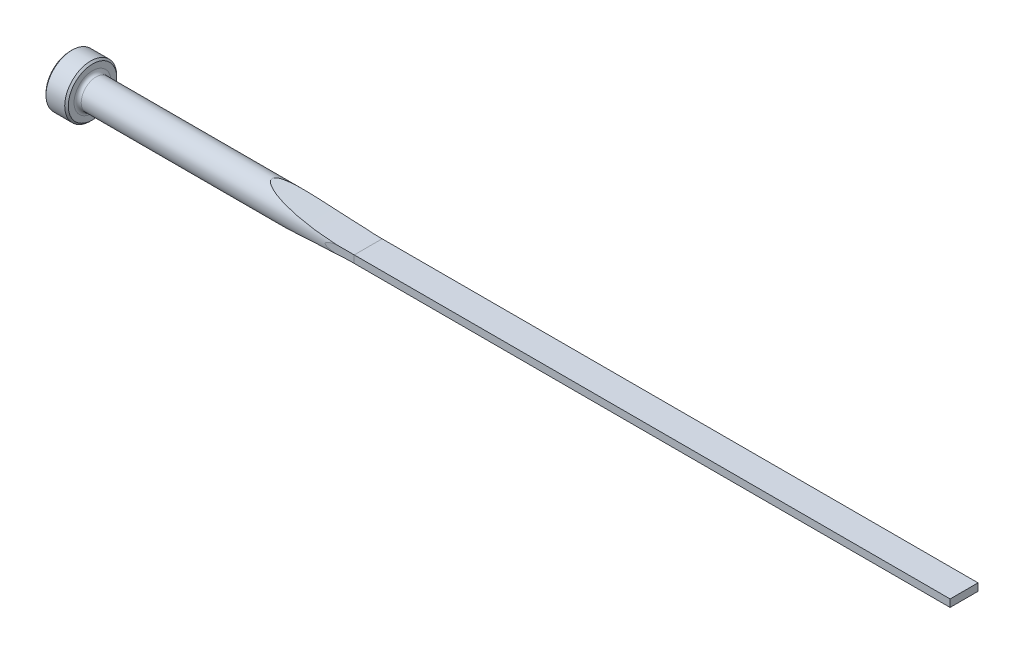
ISO-10303-21;
HEADER;
FILE_DESCRIPTION(('STEP AP214'),'2;1');
FILE_NAME('part.step','',(''),(''),'','','');
FILE_SCHEMA(('AUTOMOTIVE_DESIGN { 1 0 10303 214 1 1 1 1 }'));
ENDSEC;
DATA;
#1=APPLICATION_CONTEXT('core data for automotive mechanical design processes');
#2=APPLICATION_PROTOCOL_DEFINITION('international standard','automotive_design',2000,#1);
#3=PRODUCT_CONTEXT('',#1,'mechanical');
#4=PRODUCT('Part','Part','',(#3));
#5=PRODUCT_RELATED_PRODUCT_CATEGORY('part','',(#4));
#6=PRODUCT_DEFINITION_FORMATION('','',#4);
#7=PRODUCT_DEFINITION_CONTEXT('part definition',#1,'design');
#8=PRODUCT_DEFINITION('design','',#6,#7);
#9=PRODUCT_DEFINITION_SHAPE('','',#8);
#10=(LENGTH_UNIT() NAMED_UNIT(*) SI_UNIT(.MILLI.,.METRE.));
#11=(NAMED_UNIT(*) PLANE_ANGLE_UNIT() SI_UNIT($,.RADIAN.));
#12=(NAMED_UNIT(*) SI_UNIT($,.STERADIAN.) SOLID_ANGLE_UNIT());
#13=UNCERTAINTY_MEASURE_WITH_UNIT(LENGTH_MEASURE(1.E-05),#10,'distance_accuracy_value','');
#14=(GEOMETRIC_REPRESENTATION_CONTEXT(3) GLOBAL_UNCERTAINTY_ASSIGNED_CONTEXT((#13)) GLOBAL_UNIT_ASSIGNED_CONTEXT((#10,
#11,#12)) REPRESENTATION_CONTEXT('',''));
#15=CARTESIAN_POINT('',(0.,0.,0.));
#16=DIRECTION('',(0.,0.,1.));
#17=DIRECTION('',(1.,0.,0.));
#18=AXIS2_PLACEMENT_3D('',#15,#16,#17);
#19=CARTESIAN_POINT('',(0.,0.,0.));
#20=DIRECTION('',(-1.,0.,0.));
#21=DIRECTION('',(0.,0.,1.));
#22=AXIS2_PLACEMENT_3D('',#19,#20,#21);
#23=CYLINDRICAL_SURFACE('',#22,3.175);
#24=CARTESIAN_POINT('',(5.5118,0.,0.));
#25=DIRECTION('',(-1.,0.,0.));
#26=DIRECTION('',(0.,0.,1.));
#27=AXIS2_PLACEMENT_3D('',#24,#25,#26);
#28=CIRCLE('',#27,3.175);
#29=CARTESIAN_POINT('',(5.5118,0.,3.175));
#30=VERTEX_POINT('',#29);
#31=EDGE_CURVE('E153',#30,#30,#28,.F.);
#32=ORIENTED_EDGE('',*,*,#31,.T.);
#33=EDGE_LOOP('',(#32));
#34=FACE_BOUND('',#33,.T.);
#35=CARTESIAN_POINT('',(63.5,1.11760000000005,2.97179999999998));
#36=CARTESIAN_POINT('',(63.2357957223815,1.11753103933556,2.9717988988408));
#37=CARTESIAN_POINT('',(62.9715815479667,1.11446404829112,2.97297778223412));
#38=CARTESIAN_POINT('',(62.443191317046,1.10185346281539,2.97768913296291));
#39=CARTESIAN_POINT('',(62.1790153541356,1.09230645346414,2.98122284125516));
#40=CARTESIAN_POINT('',(61.6493837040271,1.06617269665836,2.9906669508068));
#41=CARTESIAN_POINT('',(61.3839303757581,1.04954219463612,2.99659211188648));
#42=CARTESIAN_POINT('',(60.8537877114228,1.00807205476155,3.01079697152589));
#43=CARTESIAN_POINT('',(60.5890982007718,0.983234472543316,3.01907608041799));
#44=CARTESIAN_POINT('',(60.0615789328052,0.92338352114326,3.03792875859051));
#45=CARTESIAN_POINT('',(59.7987461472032,0.888396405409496,3.04849639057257));
#46=CARTESIAN_POINT('',(59.4064659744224,0.825064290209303,3.06600005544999));
#47=CARTESIAN_POINT('',(59.2761087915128,0.802161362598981,3.07210597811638));
#48=CARTESIAN_POINT('',(59.0163554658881,0.751700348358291,3.08484243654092));
#49=CARTESIAN_POINT('',(58.8869590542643,0.724143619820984,3.09147281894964));
#50=CARTESIAN_POINT('',(58.6294078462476,0.662714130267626,3.10522998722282));
#51=CARTESIAN_POINT('',(58.5012554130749,0.628831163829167,3.11235756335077));
#52=CARTESIAN_POINT('',(58.3111286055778,0.570760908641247,3.12333709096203));
#53=CARTESIAN_POINT('',(58.2480498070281,0.550175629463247,3.12704828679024));
#54=CARTESIAN_POINT('',(58.1230456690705,0.505797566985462,3.13453462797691));
#55=CARTESIAN_POINT('',(58.061119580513,0.482006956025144,3.13830972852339));
#56=CARTESIAN_POINT('',(57.9388265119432,0.42976946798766,3.1458898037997));
#57=CARTESIAN_POINT('',(57.8784713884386,0.401294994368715,3.14969481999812));
#58=CARTESIAN_POINT('',(57.761395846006,0.337410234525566,3.1571914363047));
#59=CARTESIAN_POINT('',(57.7046630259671,0.302025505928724,3.16088339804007));
#60=CARTESIAN_POINT('',(57.6318457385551,0.243613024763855,3.16568281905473));
#61=CARTESIAN_POINT('',(57.6116878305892,0.225790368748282,3.16701915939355));
#62=CARTESIAN_POINT('',(57.5741240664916,0.187442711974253,3.16952077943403));
#63=CARTESIAN_POINT('',(57.5567070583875,0.166929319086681,3.17068675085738));
#64=CARTESIAN_POINT('',(57.5335834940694,0.132884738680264,3.17224001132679));
#65=CARTESIAN_POINT('',(57.5261886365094,0.120518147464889,3.17273788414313));
#66=CARTESIAN_POINT('',(57.5132601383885,0.0948283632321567,3.1736095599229));
#67=CARTESIAN_POINT('',(57.5077252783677,0.0815058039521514,3.17398344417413));
#68=CARTESIAN_POINT('',(57.4990082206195,0.053897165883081,3.1745727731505));
#69=CARTESIAN_POINT('',(57.4958567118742,0.0396010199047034,3.17478615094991));
#70=CARTESIAN_POINT('',(57.4924789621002,0.0106696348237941,3.17501485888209));
#71=CARTESIAN_POINT('',(57.4922487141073,-0.00396511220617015,3.17503046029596));
#72=CARTESIAN_POINT('',(57.4945596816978,-0.0309283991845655,3.17487397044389));
#73=CARTESIAN_POINT('',(57.4967167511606,-0.0432925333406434,3.17472789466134));
#74=CARTESIAN_POINT('',(57.5029656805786,-0.0675187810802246,3.17430516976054));
#75=CARTESIAN_POINT('',(57.5070594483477,-0.0793803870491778,3.17402839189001));
#76=CARTESIAN_POINT('',(57.5191372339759,-0.107852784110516,3.17321302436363));
#77=CARTESIAN_POINT('',(57.5280454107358,-0.124065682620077,3.17261252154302));
#78=CARTESIAN_POINT('',(57.5482326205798,-0.154926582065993,3.17125564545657));
#79=CARTESIAN_POINT('',(57.5595181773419,-0.169570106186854,3.1704988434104));
#80=CARTESIAN_POINT('',(57.5944341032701,-0.209900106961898,3.16816531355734));
#81=CARTESIAN_POINT('',(57.6200991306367,-0.233790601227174,3.16645919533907));
#82=CARTESIAN_POINT('',(57.6742928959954,-0.277993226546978,3.1628833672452));
#83=CARTESIAN_POINT('',(57.702830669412,-0.298293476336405,3.16101314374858));
#84=CARTESIAN_POINT('',(57.7823413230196,-0.349789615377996,3.155843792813));
#85=CARTESIAN_POINT('',(57.8348887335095,-0.37851929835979,3.15247078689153));
#86=CARTESIAN_POINT('',(57.9423072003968,-0.431320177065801,3.14567655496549));
#87=CARTESIAN_POINT('',(57.9971839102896,-0.455379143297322,3.14225522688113));
#88=CARTESIAN_POINT('',(58.1085705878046,-0.500302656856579,3.13541729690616));
#89=CARTESIAN_POINT('',(58.165087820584,-0.521149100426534,3.13200082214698));
#90=CARTESIAN_POINT('',(58.2788979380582,-0.560302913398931,3.12523191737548));
#91=CARTESIAN_POINT('',(58.3361896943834,-0.578613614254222,3.12187940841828));
#92=CARTESIAN_POINT('',(58.5297297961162,-0.636913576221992,3.1107447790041));
#93=CARTESIAN_POINT('',(58.6673130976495,-0.672489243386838,3.10314401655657));
#94=CARTESIAN_POINT('',(58.9441302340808,-0.736755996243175,3.0885058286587));
#95=CARTESIAN_POINT('',(59.0833651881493,-0.765442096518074,3.08146881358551));
#96=CARTESIAN_POINT('',(59.3631295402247,-0.817784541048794,3.06799404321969));
#97=CARTESIAN_POINT('',(59.5036611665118,-0.841429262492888,3.06155769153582));
#98=CARTESIAN_POINT('',(59.7853732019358,-0.884713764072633,3.04932851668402));
#99=CARTESIAN_POINT('',(59.9265536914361,-0.904353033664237,3.04353577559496));
#100=CARTESIAN_POINT('',(60.3506897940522,-0.95834898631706,3.02714982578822));
#101=CARTESIAN_POINT('',(60.6343099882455,-0.987796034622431,3.01754551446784));
#102=CARTESIAN_POINT('',(61.202086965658,-1.03680456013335,3.00105004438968));
#103=CARTESIAN_POINT('',(61.4862426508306,-1.05637822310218,2.99415554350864));
#104=CARTESIAN_POINT('',(61.9149168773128,-1.079629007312,2.98581493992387));
#105=CARTESIAN_POINT('',(62.059256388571,-1.08638681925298,2.98335806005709));
#106=CARTESIAN_POINT('',(62.3480641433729,-1.0978849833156,2.97914616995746));
#107=CARTESIAN_POINT('',(62.4925324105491,-1.1026248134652,2.97739134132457));
#108=CARTESIAN_POINT('',(62.780840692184,-1.1101534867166,2.97459254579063));
#109=CARTESIAN_POINT('',(62.9246804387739,-1.11295147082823,2.97354524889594));
#110=CARTESIAN_POINT('',(63.2123469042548,-1.11667170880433,2.97214903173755));
#111=CARTESIAN_POINT('',(63.3561736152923,-1.11759449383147,2.97179991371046));
#112=CARTESIAN_POINT('',(63.5,-1.11760000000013,2.97179999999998));
#113=B_SPLINE_CURVE_WITH_KNOTS('',3,(#35,#36,#37,#38,#39,#40,#41,#42,#43,#44,#45,#46,#47,#48,
#49,#50,#51,#52,#53,#54,#55,#56,#57,#58,#59,#60,#61,#62,#63,#64,#65,#66,#67,#68,#69,#70,#71,#72,
#73,#74,#75,#76,#77,#78,#79,#80,#81,#82,#83,#84,#85,#86,#87,#88,#89,#90,#91,#92,#93,#94,#95,#96,
#97,#98,#99,#100,#101,#102,#103,#104,#105,#106,#107,#108,#109,#110,#111,#112),.UNSPECIFIED.,.F.,
.F.,(4,2,2,2,2,2,2,2,2,2,2,2,2,2,2,2,2,2,2,2,2,2,2,2,2,2,2,2,2,2,2,2,2,2,2,2,2,2,4),(0.,
0.792608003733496,1.58563403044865,2.38363126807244,3.18142878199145,3.97718078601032,
4.37459807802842,4.77189959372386,5.16984765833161,5.36916585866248,5.56834964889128,
5.7687520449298,5.96842682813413,6.04909120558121,6.12941838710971,6.17255460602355,
6.21566248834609,6.25931641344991,6.30291045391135,6.34039079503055,6.37790813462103,
6.43311579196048,6.48847696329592,6.59320183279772,6.69826703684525,6.87774508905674,
7.05768691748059,7.23860836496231,7.41928981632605,7.84588397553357,8.2727859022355,
8.70066164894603,9.12859189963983,9.98423938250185,10.8388282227,11.2723701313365,
11.7060241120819,12.1376226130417,12.569098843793),.UNSPECIFIED.);
#114=CARTESIAN_POINT('',(59.6853026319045,0.86928200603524,3.05368200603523));
#115=VERTEX_POINT('',#114);
#116=CARTESIAN_POINT('',(59.6853026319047,-0.869282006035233,3.05368200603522));
#117=VERTEX_POINT('',#116);
#118=EDGE_CURVE('E156',#115,#117,#113,.T.);
#119=ORIENTED_EDGE('',*,*,#118,.F.);
#120=CARTESIAN_POINT('',(63.5,0.787399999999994,3.07581310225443));
#121=CARTESIAN_POINT('',(63.2355438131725,0.78739999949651,3.07581083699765));
#122=CARTESIAN_POINT('',(62.9710891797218,0.788580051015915,3.07551132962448));
#123=CARTESIAN_POINT('',(62.4422022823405,0.793300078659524,3.07429803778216));
#124=CARTESIAN_POINT('',(62.1777700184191,0.796840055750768,3.0733842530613));
#125=CARTESIAN_POINT('',(61.3844189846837,0.81100169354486,3.0696912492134));
#126=CARTESIAN_POINT('',(60.8555630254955,0.82516506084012,3.06596036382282));
#127=CARTESIAN_POINT('',(59.7968502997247,0.8629777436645,3.05553241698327));
#128=CARTESIAN_POINT('',(59.2669944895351,0.8866515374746,3.04882769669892));
#129=CARTESIAN_POINT('',(58.2079603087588,0.943468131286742,3.03172836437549));
#130=CARTESIAN_POINT('',(57.6787818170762,0.976608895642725,3.02133454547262));
#131=CARTESIAN_POINT('',(56.6997492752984,1.04671882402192,2.99769210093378));
#132=CARTESIAN_POINT('',(56.2497861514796,1.08238846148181,2.98509669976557));
#133=CARTESIAN_POINT('',(55.3505791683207,1.16056445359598,2.9555818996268));
#134=CARTESIAN_POINT('',(54.9013353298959,1.20307100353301,2.93866237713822));
#135=CARTESIAN_POINT('',(54.003288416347,1.29494318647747,2.89935313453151));
#136=CARTESIAN_POINT('',(53.5544863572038,1.34431625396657,2.87695746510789));
#137=CARTESIAN_POINT('',(52.6580959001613,1.44984136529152,2.82525115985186));
#138=CARTESIAN_POINT('',(52.21050743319,1.50599301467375,2.79594092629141));
#139=CARTESIAN_POINT('',(51.3157511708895,1.62515896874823,2.72840404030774));
#140=CARTESIAN_POINT('',(50.8685873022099,1.68819027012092,2.69015502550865));
#141=CARTESIAN_POINT('',(49.9762278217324,1.82090442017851,2.60217475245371));
#142=CARTESIAN_POINT('',(49.5310327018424,1.89058884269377,2.5524407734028));
#143=CARTESIAN_POINT('',(48.8659910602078,1.99985162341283,2.46644191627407));
#144=CARTESIAN_POINT('',(48.6450024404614,2.03701989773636,2.43591445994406));
#145=CARTESIAN_POINT('',(48.2039601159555,2.11291046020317,2.37039160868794));
#146=CARTESIAN_POINT('',(47.9839063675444,2.15163267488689,2.33539642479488));
#147=CARTESIAN_POINT('',(47.5450648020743,2.23055506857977,2.26013733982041));
#148=CARTESIAN_POINT('',(47.3262764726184,2.27075459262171,2.21987575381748));
#149=CARTESIAN_POINT('',(46.8902406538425,2.35255542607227,2.132997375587));
#150=CARTESIAN_POINT('',(46.6729929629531,2.39415654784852,2.08638143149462));
#151=CARTESIAN_POINT('',(46.3477545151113,2.45768704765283,2.01034767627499));
#152=CARTESIAN_POINT('',(46.2389864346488,2.4791456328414,1.9838590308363));
#153=CARTESIAN_POINT('',(46.0220867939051,2.52235662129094,1.9286178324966));
#154=CARTESIAN_POINT('',(45.913955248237,2.54410903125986,1.89986522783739));
#155=CARTESIAN_POINT('',(45.5903801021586,2.60982577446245,1.80970323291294));
#156=CARTESIAN_POINT('',(45.3760432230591,2.65419348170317,1.74445519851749));
#157=CARTESIAN_POINT('',(45.0591981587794,2.72097915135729,1.6366542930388));
#158=CARTESIAN_POINT('',(44.9548736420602,2.74316775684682,1.59927855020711));
#159=CARTESIAN_POINT('',(44.7477705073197,2.78760086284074,1.52051286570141));
#160=CARTESIAN_POINT('',(44.6449915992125,2.80984535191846,1.47912368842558));
#161=CARTESIAN_POINT('',(44.4417053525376,2.85421389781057,1.39157880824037));
#162=CARTESIAN_POINT('',(44.3411937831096,2.87633810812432,1.34543306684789));
#163=CARTESIAN_POINT('',(44.1430959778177,2.9202948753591,1.2471613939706));
#164=CARTESIAN_POINT('',(44.0455078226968,2.9421276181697,1.19503949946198));
#165=CARTESIAN_POINT('',(43.9117813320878,2.97227306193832,1.11659829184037));
#166=CARTESIAN_POINT('',(43.8738115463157,2.9808592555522,1.09349968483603));
#167=CARTESIAN_POINT('',(43.7987226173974,2.9978899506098,1.04590629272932));
#168=CARTESIAN_POINT('',(43.7616035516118,3.00633443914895,1.02141138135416));
#169=CARTESIAN_POINT('',(43.6515401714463,3.03144638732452,0.945421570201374));
#170=CARTESIAN_POINT('',(43.580121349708,3.04784006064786,0.891554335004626));
#171=CARTESIAN_POINT('',(43.4427883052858,3.0795292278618,0.775133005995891));
#172=CARTESIAN_POINT('',(43.3769534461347,3.09480855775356,0.712479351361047));
#173=CARTESIAN_POINT('',(43.2563432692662,3.12292613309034,0.576813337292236));
#174=CARTESIAN_POINT('',(43.2015101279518,3.13577711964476,0.503858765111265));
#175=CARTESIAN_POINT('',(43.1334503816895,3.1517759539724,0.385387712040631));
#176=CARTESIAN_POINT('',(43.1130844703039,3.15657317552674,0.344236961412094));
#177=CARTESIAN_POINT('',(43.078672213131,3.16468806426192,0.259216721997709));
#178=CARTESIAN_POINT('',(43.0646188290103,3.16800737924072,0.2153503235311));
#179=CARTESIAN_POINT('',(43.0441287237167,3.17284949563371,0.125287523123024));
#180=CARTESIAN_POINT('',(43.0377647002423,3.1743551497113,0.0790731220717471));
#181=CARTESIAN_POINT('',(43.033732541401,3.17530892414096,-0.0137573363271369));
#182=CARTESIAN_POINT('',(43.0360615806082,3.17475771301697,-0.0603732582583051));
#183=CARTESIAN_POINT('',(43.0484201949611,3.17183542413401,-0.147654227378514));
#184=CARTESIAN_POINT('',(43.0576480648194,3.16965382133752,-0.188444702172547));
#185=CARTESIAN_POINT('',(43.0819667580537,3.16391143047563,-0.268119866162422));
#186=CARTESIAN_POINT('',(43.0970614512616,3.16034973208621,-0.307003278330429));
#187=CARTESIAN_POINT('',(43.1419420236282,3.149776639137,-0.403821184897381));
#188=CARTESIAN_POINT('',(43.1752036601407,3.14195464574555,-0.460042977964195));
#189=CARTESIAN_POINT('',(43.2496780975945,3.12449841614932,-0.56663425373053));
#190=CARTESIAN_POINT('',(43.2909151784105,3.11485864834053,-0.616985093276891));
#191=CARTESIAN_POINT('',(43.3763515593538,3.09496038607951,-0.709911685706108));
#192=CARTESIAN_POINT('',(43.4202749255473,3.08476245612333,-0.752759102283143));
#193=CARTESIAN_POINT('',(43.5115201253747,3.06365689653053,-0.834515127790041));
#194=CARTESIAN_POINT('',(43.5588452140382,3.05274858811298,-0.873419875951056));
#195=CARTESIAN_POINT('',(43.6560433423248,3.0304333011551,-0.947952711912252));
#196=CARTESIAN_POINT('',(43.70592175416,3.01902527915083,-0.983573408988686));
#197=CARTESIAN_POINT('',(43.8074943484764,2.9958898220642,-1.05193545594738));
#198=CARTESIAN_POINT('',(43.859187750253,2.98416252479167,-1.08467802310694));
#199=CARTESIAN_POINT('',(43.9974109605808,2.95293886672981,-1.16783092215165));
#200=CARTESIAN_POINT('',(44.08513100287,2.93325796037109,-1.21619034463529));
#201=CARTESIAN_POINT('',(44.263186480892,2.89360215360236,-1.30773540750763));
#202=CARTESIAN_POINT('',(44.3535233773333,2.87362709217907,-1.35091808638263));
#203=CARTESIAN_POINT('',(44.5362397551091,2.83353099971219,-1.43311613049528));
#204=CARTESIAN_POINT('',(44.6286227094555,2.81340976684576,-1.47212362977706));
#205=CARTESIAN_POINT('',(44.8148168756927,2.77317207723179,-1.54658525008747));
#206=CARTESIAN_POINT('',(44.9086283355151,2.7530556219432,-1.58203874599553));
#207=CARTESIAN_POINT('',(45.1926824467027,2.69263186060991,-1.68424564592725));
#208=CARTESIAN_POINT('',(45.3846014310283,2.65245744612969,-1.74643627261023));
#209=CARTESIAN_POINT('',(45.6744533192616,2.59279838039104,-1.83281823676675));
#210=CARTESIAN_POINT('',(45.7713413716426,2.57302402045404,-1.86044719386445));
#211=CARTESIAN_POINT('',(45.9657197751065,2.53369185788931,-1.91366898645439));
#212=CARTESIAN_POINT('',(46.0632101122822,2.51413405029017,-1.93926186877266));
#213=CARTESIAN_POINT('',(46.3708756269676,2.45295213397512,-2.01698242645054));
#214=CARTESIAN_POINT('',(46.5819621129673,2.41176464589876,-2.0658523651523));
#215=CARTESIAN_POINT('',(47.0058251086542,2.3306671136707,-2.15692409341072));
#216=CARTESIAN_POINT('',(47.2186018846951,2.29075727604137,-2.19912480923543));
#217=CARTESIAN_POINT('',(47.6455328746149,2.21230068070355,-2.27803601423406));
#218=CARTESIAN_POINT('',(47.8596877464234,2.17375464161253,-2.31474364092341));
#219=CARTESIAN_POINT('',(48.2890012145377,2.0981138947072,-2.38351552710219));
#220=CARTESIAN_POINT('',(48.5041598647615,2.06101926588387,-2.41557953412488));
#221=CARTESIAN_POINT('',(49.1518637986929,1.95181443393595,-2.50600220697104));
#222=CARTESIAN_POINT('',(49.5856254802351,1.88196933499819,-2.55841192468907));
#223=CARTESIAN_POINT('',(50.4552081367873,1.74857514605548,-2.65135263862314));
#224=CARTESIAN_POINT('',(50.8910284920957,1.68502427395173,-2.69188700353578));
#225=CARTESIAN_POINT('',(51.764605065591,1.56427552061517,-2.76380276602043));
#226=CARTESIAN_POINT('',(52.2023624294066,1.50708213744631,-2.79517770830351));
#227=CARTESIAN_POINT('',(53.0791511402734,1.39917293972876,-2.85072181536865));
#228=CARTESIAN_POINT('',(53.5181825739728,1.34845757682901,-2.87489047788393));
#229=CARTESIAN_POINT('',(54.3966640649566,1.2536156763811,-2.91749372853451));
#230=CARTESIAN_POINT('',(54.8361128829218,1.20948085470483,-2.93593555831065));
#231=CARTESIAN_POINT('',(55.7157867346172,1.12775252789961,-2.96828666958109));
#232=CARTESIAN_POINT('',(56.1560117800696,1.09015912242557,-2.98219588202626));
#233=CARTESIAN_POINT('',(57.1721267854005,1.01101466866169,-3.01010743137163));
#234=CARTESIAN_POINT('',(57.7482336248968,0.971783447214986,-3.02283110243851));
#235=CARTESIAN_POINT('',(58.9013377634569,0.904541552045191,-3.04362622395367));
#236=CARTESIAN_POINT('',(59.4783352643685,0.876533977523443,-3.05169638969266));
#237=CARTESIAN_POINT('',(60.629420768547,0.831901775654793,-3.06416391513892));
#238=CARTESIAN_POINT('',(61.2035059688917,0.81521129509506,-3.06858255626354));
#239=CARTESIAN_POINT('',(62.0647116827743,0.798523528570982,-3.07294853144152));
#240=CARTESIAN_POINT('',(62.3517518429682,0.794352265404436,-3.07402686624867));
#241=CARTESIAN_POINT('',(62.9258606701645,0.78879050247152,-3.07545758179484));
#242=CARTESIAN_POINT('',(63.2129293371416,0.787400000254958,-3.07580996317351));
#243=CARTESIAN_POINT('',(63.5,0.78739999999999,-3.07581310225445));
#244=B_SPLINE_CURVE_WITH_KNOTS('',3,(#120,#121,#122,#123,#124,#125,#126,#127,#128,#129,#130,
#131,#132,#133,#134,#135,#136,#137,#138,#139,#140,#141,#142,#143,#144,#145,#146,#147,#148,#149,
#150,#151,#152,#153,#154,#155,#156,#157,#158,#159,#160,#161,#162,#163,#164,#165,#166,#167,#168,
#169,#170,#171,#172,#173,#174,#175,#176,#177,#178,#179,#180,#181,#182,#183,#184,#185,#186,#187,
#188,#189,#190,#191,#192,#193,#194,#195,#196,#197,#198,#199,#200,#201,#202,#203,#204,#205,#206,
#207,#208,#209,#210,#211,#212,#213,#214,#215,#216,#217,#218,#219,#220,#221,#222,#223,#224,#225,
#226,#227,#228,#229,#230,#231,#232,#233,#234,#235,#236,#237,#238,#239,#240,#241,#242,#243),
.UNSPECIFIED.,.F.,.F.,(4,2,2,2,2,2,2,2,2,2,2,2,2,2,2,2,2,2,2,2,2,2,2,2,2,2,2,2,2,2,2,2,2,2,2,2,
2,2,2,2,2,2,2,2,2,2,2,2,2,2,2,2,2,2,2,2,2,2,2,2,2,4),(0.,0.793362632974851,1.58672559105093,
3.1738026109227,4.76499095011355,6.35583739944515,7.71042211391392,9.06504552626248,
10.4211471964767,11.7771699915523,13.1366222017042,14.4963967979,15.1748434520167,
15.8532580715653,16.5313754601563,17.2094024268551,17.5513342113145,17.8932738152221,
18.5780521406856,18.917044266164,19.2559719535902,19.5942037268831,19.9322083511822,
20.0679784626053,20.203760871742,20.476139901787,20.7519011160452,21.0261726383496,
21.1642406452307,21.302154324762,21.4413619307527,21.5805242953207,21.705627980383,
21.8308143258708,22.0270516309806,22.2238960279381,22.4102246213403,22.5967339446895,
22.783653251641,22.9704931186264,23.2765002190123,23.5826815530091,23.8894299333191,
24.1962321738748,24.8129775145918,25.1209844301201,25.4289842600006,26.0904791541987,
26.7520804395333,27.4140252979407,28.0760061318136,29.4030977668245,30.7298125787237,
32.0574601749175,33.3852002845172,34.711254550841,36.0373290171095,37.7699311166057,
39.5030113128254,41.2259182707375,42.087123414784,42.948327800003),.UNSPECIFIED.);
#245=CARTESIAN_POINT('',(59.6853026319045,0.869282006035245,-3.05368200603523));
#246=VERTEX_POINT('',#245);
#247=EDGE_CURVE('E106',#115,#246,#244,.T.);
#248=ORIENTED_EDGE('',*,*,#247,.T.);
#249=CARTESIAN_POINT('',(63.5,1.11760000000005,-2.97179999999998));
#250=CARTESIAN_POINT('',(63.2357957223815,1.11753103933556,-2.9717988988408));
#251=CARTESIAN_POINT('',(62.9715815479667,1.11446404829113,-2.97297778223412));
#252=CARTESIAN_POINT('',(62.443191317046,1.10185346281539,-2.97768913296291));
#253=CARTESIAN_POINT('',(62.1790153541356,1.09230645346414,-2.98122284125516));
#254=CARTESIAN_POINT('',(61.6493837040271,1.06617269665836,-2.9906669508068));
#255=CARTESIAN_POINT('',(61.383930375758,1.04954219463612,-2.99659211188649));
#256=CARTESIAN_POINT('',(60.8537877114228,1.00807205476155,-3.01079697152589));
#257=CARTESIAN_POINT('',(60.5890982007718,0.983234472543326,-3.01907608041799));
#258=CARTESIAN_POINT('',(60.0615789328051,0.923383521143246,-3.03792875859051));
#259=CARTESIAN_POINT('',(59.7987461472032,0.888396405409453,-3.04849639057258));
#260=CARTESIAN_POINT('',(59.4064659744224,0.825064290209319,-3.06600005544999));
#261=CARTESIAN_POINT('',(59.2761087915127,0.802161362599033,-3.07210597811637));
#262=CARTESIAN_POINT('',(59.016355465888,0.751700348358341,-3.08484243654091));
#263=CARTESIAN_POINT('',(58.8869590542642,0.724143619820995,-3.09147281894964));
#264=CARTESIAN_POINT('',(58.6294078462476,0.662714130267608,-3.10522998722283));
#265=CARTESIAN_POINT('',(58.5012554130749,0.628831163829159,-3.11235756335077));
#266=CARTESIAN_POINT('',(58.3111286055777,0.57076090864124,-3.12333709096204));
#267=CARTESIAN_POINT('',(58.2480498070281,0.550175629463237,-3.12704828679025));
#268=CARTESIAN_POINT('',(58.1230456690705,0.505797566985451,-3.13453462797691));
#269=CARTESIAN_POINT('',(58.061119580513,0.482006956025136,-3.13830972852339));
#270=CARTESIAN_POINT('',(57.9388265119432,0.429769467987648,-3.14588980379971));
#271=CARTESIAN_POINT('',(57.8784713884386,0.401294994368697,-3.14969481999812));
#272=CARTESIAN_POINT('',(57.761395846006,0.337410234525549,-3.1571914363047));
#273=CARTESIAN_POINT('',(57.7046630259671,0.302025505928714,-3.16088339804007));
#274=CARTESIAN_POINT('',(57.6318457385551,0.243613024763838,-3.16568281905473));
#275=CARTESIAN_POINT('',(57.6116878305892,0.225790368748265,-3.16701915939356));
#276=CARTESIAN_POINT('',(57.5741240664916,0.187442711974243,-3.16952077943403));
#277=CARTESIAN_POINT('',(57.5567070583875,0.166929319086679,-3.17068675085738));
#278=CARTESIAN_POINT('',(57.5335834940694,0.132884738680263,-3.17224001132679));
#279=CARTESIAN_POINT('',(57.5261886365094,0.120518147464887,-3.17273788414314));
#280=CARTESIAN_POINT('',(57.5132601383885,0.0948283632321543,-3.1736095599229));
#281=CARTESIAN_POINT('',(57.5077252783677,0.0815058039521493,-3.17398344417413));
#282=CARTESIAN_POINT('',(57.4990082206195,0.0538971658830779,-3.1745727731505));
#283=CARTESIAN_POINT('',(57.4958567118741,0.0396010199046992,-3.17478615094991));
#284=CARTESIAN_POINT('',(57.4924789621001,0.0106696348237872,-3.17501485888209));
#285=CARTESIAN_POINT('',(57.4922487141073,-0.00396511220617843,-3.17503046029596));
#286=CARTESIAN_POINT('',(57.4945596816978,-0.0309283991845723,-3.17487397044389));
#287=CARTESIAN_POINT('',(57.4967167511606,-0.0432925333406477,-3.17472789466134));
#288=CARTESIAN_POINT('',(57.5029656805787,-0.0675187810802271,-3.17430516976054));
#289=CARTESIAN_POINT('',(57.5070594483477,-0.0793803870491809,-3.17402839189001));
#290=CARTESIAN_POINT('',(57.5191372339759,-0.107852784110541,-3.17321302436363));
#291=CARTESIAN_POINT('',(57.5280454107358,-0.124065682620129,-3.17261252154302));
#292=CARTESIAN_POINT('',(57.5482326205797,-0.154926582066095,-3.17125564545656));
#293=CARTESIAN_POINT('',(57.5595181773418,-0.16957010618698,-3.17049884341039));
#294=CARTESIAN_POINT('',(57.59443410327,-0.209900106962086,-3.16816531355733));
#295=CARTESIAN_POINT('',(57.6200991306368,-0.233790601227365,-3.16645919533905));
#296=CARTESIAN_POINT('',(57.6742928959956,-0.277993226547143,-3.16288336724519));
#297=CARTESIAN_POINT('',(57.7028306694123,-0.298293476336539,-3.16101314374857));
#298=CARTESIAN_POINT('',(57.7823413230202,-0.349789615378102,-3.15584379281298));
#299=CARTESIAN_POINT('',(57.8348887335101,-0.378519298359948,-3.15247078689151));
#300=CARTESIAN_POINT('',(57.9423072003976,-0.431320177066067,-3.14567655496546));
#301=CARTESIAN_POINT('',(57.9971839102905,-0.455379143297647,-3.14225522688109));
#302=CARTESIAN_POINT('',(58.1085705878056,-0.500302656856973,-3.13541729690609));
#303=CARTESIAN_POINT('',(58.1650878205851,-0.52114910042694,-3.13200082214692));
#304=CARTESIAN_POINT('',(58.2788979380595,-0.56030291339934,-3.12523191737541));
#305=CARTESIAN_POINT('',(58.3361896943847,-0.578613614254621,-3.12187940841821));
#306=CARTESIAN_POINT('',(58.5297297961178,-0.636913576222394,-3.11074477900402));
#307=CARTESIAN_POINT('',(58.6673130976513,-0.672489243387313,-3.10314401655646));
#308=CARTESIAN_POINT('',(58.9441302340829,-0.736755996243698,-3.08850582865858));
#309=CARTESIAN_POINT('',(59.0833651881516,-0.76544209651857,-3.08146881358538));
#310=CARTESIAN_POINT('',(59.3631295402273,-0.81778454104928,-3.06799404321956));
#311=CARTESIAN_POINT('',(59.5036611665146,-0.84142926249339,-3.06155769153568));
#312=CARTESIAN_POINT('',(59.7853732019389,-0.884713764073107,-3.04932851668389));
#313=CARTESIAN_POINT('',(59.9265536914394,-0.904353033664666,-3.04353577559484));
#314=CARTESIAN_POINT('',(60.3506897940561,-0.95834898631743,-3.0271498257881));
#315=CARTESIAN_POINT('',(60.6343099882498,-0.987796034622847,-3.0175455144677));
#316=CARTESIAN_POINT('',(61.2020869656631,-1.0368045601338,-3.00105004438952));
#317=CARTESIAN_POINT('',(61.4862426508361,-1.05637822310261,-2.99415554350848));
#318=CARTESIAN_POINT('',(61.9149168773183,-1.0796290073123,-2.98581493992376));
#319=CARTESIAN_POINT('',(62.059256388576,-1.0863868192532,-2.98335806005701));
#320=CARTESIAN_POINT('',(62.348064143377,-1.09788498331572,-2.97914616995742));
#321=CARTESIAN_POINT('',(62.4925324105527,-1.10262481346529,-2.97739134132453));
#322=CARTESIAN_POINT('',(62.7808406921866,-1.11015348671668,-2.9745925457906));
#323=CARTESIAN_POINT('',(62.924680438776,-1.11295147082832,-2.97354524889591));
#324=CARTESIAN_POINT('',(63.2123469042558,-1.11667170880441,-2.97214903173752));
#325=CARTESIAN_POINT('',(63.3561736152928,-1.11759449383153,-2.97179991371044));
#326=CARTESIAN_POINT('',(63.5,-1.11760000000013,-2.97179999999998));
#327=B_SPLINE_CURVE_WITH_KNOTS('',3,(#249,#250,#251,#252,#253,#254,#255,#256,#257,#258,#259,
#260,#261,#262,#263,#264,#265,#266,#267,#268,#269,#270,#271,#272,#273,#274,#275,#276,#277,#278,
#279,#280,#281,#282,#283,#284,#285,#286,#287,#288,#289,#290,#291,#292,#293,#294,#295,#296,#297,
#298,#299,#300,#301,#302,#303,#304,#305,#306,#307,#308,#309,#310,#311,#312,#313,#314,#315,#316,
#317,#318,#319,#320,#321,#322,#323,#324,#325,#326),.UNSPECIFIED.,.F.,.F.,(4,2,2,2,2,2,2,2,2,2,2,
2,2,2,2,2,2,2,2,2,2,2,2,2,2,2,2,2,2,2,2,2,2,2,2,2,2,2,4),(0.,0.792608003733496,1.58563403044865,
2.38363126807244,3.18142878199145,3.97718078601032,4.37459807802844,4.77189959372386,
5.16984765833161,5.36916585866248,5.56834964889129,5.7687520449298,5.96842682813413,
6.04909120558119,6.12941838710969,6.17255460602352,6.21566248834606,6.25931641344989,
6.30291045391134,6.34039079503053,6.37790813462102,6.43311579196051,6.48847696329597,
6.59320183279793,6.69826703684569,6.87774508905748,7.05768691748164,7.23860836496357,
7.41928981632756,7.84588397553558,8.27278590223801,8.70066164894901,9.12859189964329,
9.98423938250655,10.838828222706,11.272370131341,11.706024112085,12.1376226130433,
12.569098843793),.UNSPECIFIED.);
#328=CARTESIAN_POINT('',(59.6853026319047,-0.869282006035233,-3.05368200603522));
#329=VERTEX_POINT('',#328);
#330=EDGE_CURVE('E175',#246,#329,#327,.T.);
#331=ORIENTED_EDGE('',*,*,#330,.T.);
#332=CARTESIAN_POINT('',(63.5,-0.787399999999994,3.07581310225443));
#333=CARTESIAN_POINT('',(63.2355438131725,-0.787399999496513,3.07581083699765));
#334=CARTESIAN_POINT('',(62.9710891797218,-0.788580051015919,3.07551132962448));
#335=CARTESIAN_POINT('',(62.4422022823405,-0.793300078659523,3.07429803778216));
#336=CARTESIAN_POINT('',(62.1777700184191,-0.796840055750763,3.07338425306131));
#337=CARTESIAN_POINT('',(61.3844189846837,-0.811001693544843,3.06969124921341));
#338=CARTESIAN_POINT('',(60.8555630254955,-0.825165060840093,3.06596036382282));
#339=CARTESIAN_POINT('',(59.7968502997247,-0.862977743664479,3.05553241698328));
#340=CARTESIAN_POINT('',(59.2669944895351,-0.886651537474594,3.04882769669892));
#341=CARTESIAN_POINT('',(58.2079603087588,-0.943468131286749,3.03172836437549));
#342=CARTESIAN_POINT('',(57.6787818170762,-0.976608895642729,3.02133454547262));
#343=CARTESIAN_POINT('',(56.6997492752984,-1.04671882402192,2.99769210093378));
#344=CARTESIAN_POINT('',(56.2497861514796,-1.0823884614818,2.98509669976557));
#345=CARTESIAN_POINT('',(55.3505791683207,-1.16056445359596,2.95558189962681));
#346=CARTESIAN_POINT('',(54.9013353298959,-1.20307100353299,2.93866237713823));
#347=CARTESIAN_POINT('',(54.0032884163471,-1.29494318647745,2.89935313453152));
#348=CARTESIAN_POINT('',(53.5544863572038,-1.34431625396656,2.8769574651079));
#349=CARTESIAN_POINT('',(52.6580959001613,-1.44984136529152,2.82525115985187));
#350=CARTESIAN_POINT('',(52.21050743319,-1.50599301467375,2.79594092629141));
#351=CARTESIAN_POINT('',(51.3157511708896,-1.62515896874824,2.72840404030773));
#352=CARTESIAN_POINT('',(50.8685873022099,-1.68819027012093,2.69015502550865));
#353=CARTESIAN_POINT('',(49.9762278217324,-1.82090442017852,2.6021747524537));
#354=CARTESIAN_POINT('',(49.5310327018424,-1.89058884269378,2.5524407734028));
#355=CARTESIAN_POINT('',(48.8659910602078,-1.99985162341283,2.46644191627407));
#356=CARTESIAN_POINT('',(48.6450024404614,-2.03701989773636,2.43591445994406));
#357=CARTESIAN_POINT('',(48.2039601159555,-2.11291046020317,2.37039160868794));
#358=CARTESIAN_POINT('',(47.9839063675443,-2.15163267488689,2.33539642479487));
#359=CARTESIAN_POINT('',(47.5450648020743,-2.23055506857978,2.2601373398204));
#360=CARTESIAN_POINT('',(47.3262764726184,-2.27075459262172,2.21987575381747));
#361=CARTESIAN_POINT('',(46.8902406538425,-2.35255542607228,2.13299737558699));
#362=CARTESIAN_POINT('',(46.6729929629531,-2.39415654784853,2.08638143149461));
#363=CARTESIAN_POINT('',(46.3477545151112,-2.45768704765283,2.01034767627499));
#364=CARTESIAN_POINT('',(46.2389864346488,-2.47914563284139,1.98385903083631));
#365=CARTESIAN_POINT('',(46.022086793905,-2.52235662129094,1.9286178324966));
#366=CARTESIAN_POINT('',(45.913955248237,-2.54410903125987,1.89986522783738));
#367=CARTESIAN_POINT('',(45.5903801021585,-2.60982577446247,1.8097032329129));
#368=CARTESIAN_POINT('',(45.3760432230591,-2.65419348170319,1.74445519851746));
#369=CARTESIAN_POINT('',(45.0591981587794,-2.7209791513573,1.63665429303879));
#370=CARTESIAN_POINT('',(44.9548736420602,-2.74316775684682,1.59927855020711));
#371=CARTESIAN_POINT('',(44.7477705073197,-2.78760086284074,1.52051286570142));
#372=CARTESIAN_POINT('',(44.6449915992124,-2.80984535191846,1.47912368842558));
#373=CARTESIAN_POINT('',(44.4417053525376,-2.85421389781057,1.39157880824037));
#374=CARTESIAN_POINT('',(44.3411937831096,-2.87633810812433,1.34543306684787));
#375=CARTESIAN_POINT('',(44.1430959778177,-2.92029487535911,1.24716139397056));
#376=CARTESIAN_POINT('',(44.0455078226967,-2.94212761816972,1.19503949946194));
#377=CARTESIAN_POINT('',(43.9117813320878,-2.97227306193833,1.11659829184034));
#378=CARTESIAN_POINT('',(43.8738115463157,-2.98085925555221,1.09349968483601));
#379=CARTESIAN_POINT('',(43.7987226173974,-2.9978899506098,1.0459062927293));
#380=CARTESIAN_POINT('',(43.7616035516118,-3.00633443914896,1.02141138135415));
#381=CARTESIAN_POINT('',(43.6515401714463,-3.03144638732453,0.945421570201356));
#382=CARTESIAN_POINT('',(43.580121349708,-3.04784006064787,0.891554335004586));
#383=CARTESIAN_POINT('',(43.4427883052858,-3.07952922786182,0.775133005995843));
#384=CARTESIAN_POINT('',(43.3769534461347,-3.09480855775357,0.712479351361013));
#385=CARTESIAN_POINT('',(43.2563432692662,-3.12292613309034,0.576813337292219));
#386=CARTESIAN_POINT('',(43.2015101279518,-3.13577711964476,0.503858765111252));
#387=CARTESIAN_POINT('',(43.1334503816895,-3.1517759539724,0.385387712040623));
#388=CARTESIAN_POINT('',(43.1130844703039,-3.15657317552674,0.344236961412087));
#389=CARTESIAN_POINT('',(43.078672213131,-3.16468806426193,0.259216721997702));
#390=CARTESIAN_POINT('',(43.0646188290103,-3.16800737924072,0.215350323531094));
#391=CARTESIAN_POINT('',(43.0441287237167,-3.17284949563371,0.125287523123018));
#392=CARTESIAN_POINT('',(43.0377647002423,-3.1743551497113,0.0790731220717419));
#393=CARTESIAN_POINT('',(43.033732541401,-3.17530892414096,-0.0137573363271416));
#394=CARTESIAN_POINT('',(43.0360615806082,-3.17475771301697,-0.0603732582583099));
#395=CARTESIAN_POINT('',(43.0484201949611,-3.17183542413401,-0.147654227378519));
#396=CARTESIAN_POINT('',(43.0576480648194,-3.16965382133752,-0.188444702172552));
#397=CARTESIAN_POINT('',(43.0819667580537,-3.16391143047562,-0.268119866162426));
#398=CARTESIAN_POINT('',(43.0970614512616,-3.16034973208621,-0.307003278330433));
#399=CARTESIAN_POINT('',(43.1419420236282,-3.149776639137,-0.403821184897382));
#400=CARTESIAN_POINT('',(43.1752036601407,-3.14195464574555,-0.460042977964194));
#401=CARTESIAN_POINT('',(43.2496780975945,-3.12449841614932,-0.566634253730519));
#402=CARTESIAN_POINT('',(43.2909151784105,-3.11485864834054,-0.616985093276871));
#403=CARTESIAN_POINT('',(43.3763515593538,-3.09496038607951,-0.709911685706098));
#404=CARTESIAN_POINT('',(43.4202749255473,-3.08476245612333,-0.752759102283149));
#405=CARTESIAN_POINT('',(43.5115201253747,-3.06365689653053,-0.83451512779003));
#406=CARTESIAN_POINT('',(43.5588452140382,-3.052748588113,-0.873419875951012));
#407=CARTESIAN_POINT('',(43.6560433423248,-3.03043330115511,-0.947952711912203));
#408=CARTESIAN_POINT('',(43.70592175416,-3.01902527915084,-0.983573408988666));
#409=CARTESIAN_POINT('',(43.8074943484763,-2.9958898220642,-1.05193545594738));
#410=CARTESIAN_POINT('',(43.859187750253,-2.98416252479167,-1.08467802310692));
#411=CARTESIAN_POINT('',(43.9974109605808,-2.95293886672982,-1.16783092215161));
#412=CARTESIAN_POINT('',(44.08513100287,-2.93325796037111,-1.21619034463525));
#413=CARTESIAN_POINT('',(44.2631864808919,-2.89360215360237,-1.3077354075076));
#414=CARTESIAN_POINT('',(44.3535233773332,-2.87362709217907,-1.35091808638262));
#415=CARTESIAN_POINT('',(44.536239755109,-2.8335309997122,-1.43311613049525));
#416=CARTESIAN_POINT('',(44.6286227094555,-2.81340976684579,-1.47212362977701));
#417=CARTESIAN_POINT('',(44.8148168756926,-2.77317207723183,-1.54658525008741));
#418=CARTESIAN_POINT('',(44.9086283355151,-2.75305562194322,-1.58203874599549));
#419=CARTESIAN_POINT('',(45.1926824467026,-2.69263186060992,-1.68424564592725));
#420=CARTESIAN_POINT('',(45.3846014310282,-2.6524574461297,-1.74643627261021));
#421=CARTESIAN_POINT('',(45.6744533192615,-2.59279838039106,-1.83281823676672));
#422=CARTESIAN_POINT('',(45.7713413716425,-2.57302402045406,-1.86044719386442));
#423=CARTESIAN_POINT('',(45.9657197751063,-2.53369185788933,-1.91366898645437));
#424=CARTESIAN_POINT('',(46.0632101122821,-2.51413405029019,-1.93926186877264));
#425=CARTESIAN_POINT('',(46.3708756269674,-2.45295213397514,-2.01698242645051));
#426=CARTESIAN_POINT('',(46.5819621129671,-2.41176464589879,-2.06585236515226));
#427=CARTESIAN_POINT('',(47.0058251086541,-2.33066711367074,-2.15692409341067));
#428=CARTESIAN_POINT('',(47.2186018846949,-2.2907572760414,-2.1991248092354));
#429=CARTESIAN_POINT('',(47.6455328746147,-2.21230068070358,-2.27803601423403));
#430=CARTESIAN_POINT('',(47.8596877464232,-2.17375464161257,-2.31474364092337));
#431=CARTESIAN_POINT('',(48.2890012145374,-2.09811389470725,-2.38351552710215));
#432=CARTESIAN_POINT('',(48.5041598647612,-2.06101926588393,-2.41557953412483));
#433=CARTESIAN_POINT('',(49.1518637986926,-1.95181443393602,-2.50600220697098));
#434=CARTESIAN_POINT('',(49.5856254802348,-1.88196933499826,-2.55841192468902));
#435=CARTESIAN_POINT('',(50.4552081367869,-1.74857514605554,-2.6513526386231));
#436=CARTESIAN_POINT('',(50.8910284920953,-1.68502427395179,-2.69188700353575));
#437=CARTESIAN_POINT('',(51.7646050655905,-1.56427552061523,-2.7638027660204));
#438=CARTESIAN_POINT('',(52.2023624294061,-1.50708213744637,-2.79517770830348));
#439=CARTESIAN_POINT('',(53.0791511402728,-1.39917293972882,-2.85072181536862));
#440=CARTESIAN_POINT('',(53.5181825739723,-1.34845757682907,-2.87489047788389));
#441=CARTESIAN_POINT('',(54.396664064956,-1.25361567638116,-2.91749372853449));
#442=CARTESIAN_POINT('',(54.8361128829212,-1.20948085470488,-2.93593555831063));
#443=CARTESIAN_POINT('',(55.7157867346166,-1.12775252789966,-2.96828666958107));
#444=CARTESIAN_POINT('',(56.156011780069,-1.09015912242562,-2.98219588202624));
#445=CARTESIAN_POINT('',(57.1721267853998,-1.01101466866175,-3.01010743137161));
#446=CARTESIAN_POINT('',(57.7482336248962,-0.97178344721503,-3.02283110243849));
#447=CARTESIAN_POINT('',(58.9013377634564,-0.904541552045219,-3.04362622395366));
#448=CARTESIAN_POINT('',(59.4783352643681,-0.876533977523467,-3.05169638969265));
#449=CARTESIAN_POINT('',(60.6294207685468,-0.831901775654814,-3.06416391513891));
#450=CARTESIAN_POINT('',(61.2035059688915,-0.815211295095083,-3.06858255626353));
#451=CARTESIAN_POINT('',(62.0647116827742,-0.798523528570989,-3.07294853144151));
#452=CARTESIAN_POINT('',(62.3517518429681,-0.794352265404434,-3.07402686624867));
#453=CARTESIAN_POINT('',(62.9258606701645,-0.788790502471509,-3.07545758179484));
#454=CARTESIAN_POINT('',(63.2129293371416,-0.787400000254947,-3.07580996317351));
#455=CARTESIAN_POINT('',(63.5,-0.787399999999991,-3.07581310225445));
#456=B_SPLINE_CURVE_WITH_KNOTS('',3,(#332,#333,#334,#335,#336,#337,#338,#339,#340,#341,#342,
#343,#344,#345,#346,#347,#348,#349,#350,#351,#352,#353,#354,#355,#356,#357,#358,#359,#360,#361,
#362,#363,#364,#365,#366,#367,#368,#369,#370,#371,#372,#373,#374,#375,#376,#377,#378,#379,#380,
#381,#382,#383,#384,#385,#386,#387,#388,#389,#390,#391,#392,#393,#394,#395,#396,#397,#398,#399,
#400,#401,#402,#403,#404,#405,#406,#407,#408,#409,#410,#411,#412,#413,#414,#415,#416,#417,#418,
#419,#420,#421,#422,#423,#424,#425,#426,#427,#428,#429,#430,#431,#432,#433,#434,#435,#436,#437,
#438,#439,#440,#441,#442,#443,#444,#445,#446,#447,#448,#449,#450,#451,#452,#453,#454,#455),
.UNSPECIFIED.,.F.,.F.,(4,2,2,2,2,2,2,2,2,2,2,2,2,2,2,2,2,2,2,2,2,2,2,2,2,2,2,2,2,2,2,2,2,2,2,2,
2,2,2,2,2,2,2,2,2,2,2,2,2,2,2,2,2,2,2,2,2,2,2,2,2,4),(0.,0.793362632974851,1.58672559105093,
3.17380261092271,4.76499095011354,6.35583739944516,7.71042211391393,9.06504552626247,
10.4211471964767,11.7771699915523,13.1366222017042,14.4963967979,15.1748434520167,
15.8532580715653,16.5313754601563,17.2094024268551,17.5513342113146,17.8932738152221,
18.5780521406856,18.917044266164,19.2559719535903,19.5942037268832,19.9322083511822,
20.0679784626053,20.2037608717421,20.4761399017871,20.7519011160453,21.0261726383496,
21.1642406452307,21.302154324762,21.4413619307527,21.5805242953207,21.705627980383,
21.8308143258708,22.0270516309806,22.2238960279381,22.4102246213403,22.5967339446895,
22.7836532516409,22.9704931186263,23.2765002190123,23.5826815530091,23.889429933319,
24.1962321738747,24.8129775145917,25.12098443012,25.4289842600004,26.0904791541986,
26.752080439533,27.4140252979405,28.0760061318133,29.4030977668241,30.7298125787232,
32.057460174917,33.3852002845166,34.7112545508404,36.0373290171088,37.7699311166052,
39.5030113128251,41.2259182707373,42.087123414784,42.9483278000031),.UNSPECIFIED.);
#457=EDGE_CURVE('E105',#117,#329,#456,.T.);
#458=ORIENTED_EDGE('',*,*,#457,.F.);
#459=EDGE_LOOP('',(#119,#248,#331,#458));
#460=FACE_BOUND('',#459,.T.);
#461=ADVANCED_FACE('F33',(#34,#460),#23,.T.);
#462=CARTESIAN_POINT('',(190.5,3.175,0.));
#463=DIRECTION('',(-1.,0.,0.));
#464=DIRECTION('',(0.,0.,1.));
#465=AXIS2_PLACEMENT_3D('',#462,#463,#464);
#466=PLANE('',#465);
#467=DIRECTION('',(0.,1.,0.));
#468=VECTOR('',#467,1.);
#469=CARTESIAN_POINT('',(190.5,-5.5499,2.9718));
#470=LINE('',#469,#468);
#471=CARTESIAN_POINT('',(190.5,-0.787400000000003,2.9718));
#472=VERTEX_POINT('',#471);
#473=CARTESIAN_POINT('',(190.5,0.787400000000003,2.9718));
#474=VERTEX_POINT('',#473);
#475=EDGE_CURVE('E87',#472,#474,#470,.T.);
#476=ORIENTED_EDGE('',*,*,#475,.F.);
#477=DIRECTION('',(0.,0.,1.));
#478=VECTOR('',#477,1.);
#479=CARTESIAN_POINT('',(190.5,-0.787400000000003,0.));
#480=LINE('',#479,#478);
#481=CARTESIAN_POINT('',(190.5,-0.787400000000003,-2.97179999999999));
#482=VERTEX_POINT('',#481);
#483=EDGE_CURVE('E100',#482,#472,#480,.T.);
#484=ORIENTED_EDGE('',*,*,#483,.F.);
#485=DIRECTION('',(0.,1.,0.));
#486=VECTOR('',#485,1.);
#487=CARTESIAN_POINT('',(190.5,-5.5499,-2.9718));
#488=LINE('',#487,#486);
#489=CARTESIAN_POINT('',(190.5,0.787399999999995,-2.9718));
#490=VERTEX_POINT('',#489);
#491=EDGE_CURVE('E56',#482,#490,#488,.T.);
#492=ORIENTED_EDGE('',*,*,#491,.T.);
#493=DIRECTION('',(0.,0.,1.));
#494=VECTOR('',#493,1.);
#495=CARTESIAN_POINT('',(190.5,0.787400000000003,0.));
#496=LINE('',#495,#494);
#497=EDGE_CURVE('E102',#490,#474,#496,.T.);
#498=ORIENTED_EDGE('',*,*,#497,.T.);
#499=EDGE_LOOP('',(#476,#484,#492,#498));
#500=FACE_BOUND('',#499,.T.);
#501=ADVANCED_FACE('F99',(#500),#466,.F.);
#502=CARTESIAN_POINT('',(63.5,89.6874,-5.5499));
#503=DIRECTION('',(0.,0.,1.));
#504=DIRECTION('',(1.,0.,0.));
#505=AXIS2_PLACEMENT_3D('',#502,#503,#504);
#506=CYLINDRICAL_SURFACE('',#505,88.9);
#507=CARTESIAN_POINT('',(63.5,89.6874,91.8718));
#508=DIRECTION('',(0.,-0.707106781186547,0.707106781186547));
#509=DIRECTION('',(0.,0.707106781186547,0.707106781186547));
#510=AXIS2_PLACEMENT_3D('',#507,#508,#509);
#511=ELLIPSE('',#510,125.723585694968,88.9);
#512=CARTESIAN_POINT('',(63.5,0.787399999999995,2.97179999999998));
#513=VERTEX_POINT('',#512);
#514=EDGE_CURVE('E162',#513,#115,#511,.F.);
#515=ORIENTED_EDGE('',*,*,#514,.F.);
#516=DIRECTION('',(0.,0.,1.));
#517=VECTOR('',#516,1.);
#518=CARTESIAN_POINT('',(63.5,0.787399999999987,-5.5499));
#519=LINE('',#518,#517);
#520=CARTESIAN_POINT('',(63.5,0.787399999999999,-2.97179999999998));
#521=VERTEX_POINT('',#520);
#522=EDGE_CURVE('E170',#521,#513,#519,.T.);
#523=ORIENTED_EDGE('',*,*,#522,.F.);
#524=CARTESIAN_POINT('',(63.5,89.6874,-91.8718));
#525=DIRECTION('',(0.,0.707106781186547,0.707106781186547));
#526=DIRECTION('',(0.,-0.707106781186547,0.707106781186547));
#527=AXIS2_PLACEMENT_3D('',#524,#525,#526);
#528=ELLIPSE('',#527,125.723585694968,88.9);
#529=EDGE_CURVE('E169',#521,#246,#528,.F.);
#530=ORIENTED_EDGE('',*,*,#529,.T.);
#531=ORIENTED_EDGE('',*,*,#247,.F.);
#532=EDGE_LOOP('',(#515,#523,#530,#531));
#533=FACE_BOUND('',#532,.T.);
#534=ADVANCED_FACE('F138',(#533),#506,.F.);
#535=CARTESIAN_POINT('',(190.5,0.787400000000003,-5.5499));
#536=DIRECTION('',(0.,-1.,0.));
#537=DIRECTION('',(1.,0.,0.));
#538=AXIS2_PLACEMENT_3D('',#535,#536,#537);
#539=PLANE('',#538);
#540=DIRECTION('',(-1.,0.,0.));
#541=VECTOR('',#540,1.);
#542=CARTESIAN_POINT('',(190.5,0.787400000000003,2.9718));
#543=LINE('',#542,#541);
#544=EDGE_CURVE('E188',#474,#513,#543,.T.);
#545=ORIENTED_EDGE('',*,*,#544,.F.);
#546=ORIENTED_EDGE('',*,*,#497,.F.);
#547=DIRECTION('',(-1.,0.,0.));
#548=VECTOR('',#547,1.);
#549=CARTESIAN_POINT('',(190.5,0.787400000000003,-2.9718));
#550=LINE('',#549,#548);
#551=EDGE_CURVE('E174',#490,#521,#550,.T.);
#552=ORIENTED_EDGE('',*,*,#551,.T.);
#553=ORIENTED_EDGE('',*,*,#522,.T.);
#554=EDGE_LOOP('',(#545,#546,#552,#553));
#555=FACE_BOUND('',#554,.T.);
#556=ADVANCED_FACE('F129',(#555),#539,.F.);
#557=CARTESIAN_POINT('',(63.5,-89.6874,-5.5499));
#558=DIRECTION('',(0.,0.,1.));
#559=DIRECTION('',(1.,0.,0.));
#560=AXIS2_PLACEMENT_3D('',#557,#558,#559);
#561=CYLINDRICAL_SURFACE('',#560,88.9);
#562=DIRECTION('',(0.,0.,1.));
#563=VECTOR('',#562,1.);
#564=CARTESIAN_POINT('',(63.5,-0.787399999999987,-5.5499));
#565=LINE('',#564,#563);
#566=CARTESIAN_POINT('',(63.5,-0.787399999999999,-2.97179999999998));
#567=VERTEX_POINT('',#566);
#568=CARTESIAN_POINT('',(63.5,-0.787399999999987,2.97179999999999));
#569=VERTEX_POINT('',#568);
#570=EDGE_CURVE('E178',#567,#569,#565,.T.);
#571=ORIENTED_EDGE('',*,*,#570,.T.);
#572=CARTESIAN_POINT('',(63.5,-89.6874,91.8718));
#573=DIRECTION('',(0.,0.707106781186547,0.707106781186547));
#574=DIRECTION('',(0.,-0.707106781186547,0.707106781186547));
#575=AXIS2_PLACEMENT_3D('',#572,#573,#574);
#576=ELLIPSE('',#575,125.723585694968,88.9);
#577=EDGE_CURVE('E163',#569,#117,#576,.T.);
#578=ORIENTED_EDGE('',*,*,#577,.T.);
#579=ORIENTED_EDGE('',*,*,#457,.T.);
#580=CARTESIAN_POINT('',(63.5,-89.6874,-91.8718));
#581=DIRECTION('',(0.,-0.707106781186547,0.707106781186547));
#582=DIRECTION('',(0.,0.707106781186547,0.707106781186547));
#583=AXIS2_PLACEMENT_3D('',#580,#581,#582);
#584=ELLIPSE('',#583,125.723585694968,88.9);
#585=EDGE_CURVE('E180',#567,#329,#584,.T.);
#586=ORIENTED_EDGE('',*,*,#585,.F.);
#587=EDGE_LOOP('',(#571,#578,#579,#586));
#588=FACE_BOUND('',#587,.T.);
#589=ADVANCED_FACE('F124',(#588),#561,.F.);
#590=CARTESIAN_POINT('',(190.5,-0.787400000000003,-5.5499));
#591=DIRECTION('',(0.,-1.,0.));
#592=DIRECTION('',(1.,0.,0.));
#593=AXIS2_PLACEMENT_3D('',#590,#591,#592);
#594=PLANE('',#593);
#595=ORIENTED_EDGE('',*,*,#483,.T.);
#596=DIRECTION('',(-1.,0.,0.));
#597=VECTOR('',#596,1.);
#598=CARTESIAN_POINT('',(190.5,-0.787400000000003,2.9718));
#599=LINE('',#598,#597);
#600=EDGE_CURVE('E84',#472,#569,#599,.T.);
#601=ORIENTED_EDGE('',*,*,#600,.T.);
#602=ORIENTED_EDGE('',*,*,#570,.F.);
#603=DIRECTION('',(-1.,0.,0.));
#604=VECTOR('',#603,1.);
#605=CARTESIAN_POINT('',(190.5,-0.787400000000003,-2.9718));
#606=LINE('',#605,#604);
#607=EDGE_CURVE('E94',#482,#567,#606,.T.);
#608=ORIENTED_EDGE('',*,*,#607,.F.);
#609=EDGE_LOOP('',(#595,#601,#602,#608));
#610=FACE_BOUND('',#609,.T.);
#611=ADVANCED_FACE('F104',(#610),#594,.T.);
#612=CARTESIAN_POINT('',(0.,0.,0.));
#613=DIRECTION('',(1.,0.,0.));
#614=DIRECTION('',(0.,0.,-1.));
#615=AXIS2_PLACEMENT_3D('',#612,#613,#614);
#616=PLANE('',#615);
#617=CARTESIAN_POINT('',(0.,0.,0.));
#618=DIRECTION('',(1.,0.,0.));
#619=DIRECTION('',(0.,0.,-1.));
#620=AXIS2_PLACEMENT_3D('',#617,#618,#619);
#621=CIRCLE('',#620,5.16890000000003);
#622=CARTESIAN_POINT('',(0.,0.,-5.16890000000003));
#623=VERTEX_POINT('',#622);
#624=EDGE_CURVE('E239',#623,#623,#621,.F.);
#625=ORIENTED_EDGE('',*,*,#624,.T.);
#626=EDGE_LOOP('',(#625));
#627=FACE_BOUND('',#626,.T.);
#628=ADVANCED_FACE('F136',(#627),#616,.F.);
#629=CARTESIAN_POINT('',(0.,0.,0.));
#630=DIRECTION('',(-1.,0.,0.));
#631=DIRECTION('',(0.,0.,1.));
#632=AXIS2_PLACEMENT_3D('',#629,#630,#631);
#633=CYLINDRICAL_SURFACE('',#632,5.5499);
#634=CARTESIAN_POINT('',(0.380999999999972,0.,0.));
#635=DIRECTION('',(1.,0.,0.));
#636=DIRECTION('',(0.,0.,-1.));
#637=AXIS2_PLACEMENT_3D('',#634,#635,#636);
#638=CIRCLE('',#637,5.5499);
#639=CARTESIAN_POINT('',(0.380999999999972,0.,-5.5499));
#640=VERTEX_POINT('',#639);
#641=EDGE_CURVE('E41',#640,#640,#638,.T.);
#642=ORIENTED_EDGE('',*,*,#641,.T.);
#643=EDGE_LOOP('',(#642));
#644=FACE_BOUND('',#643,.T.);
#645=CARTESIAN_POINT('',(4.36880000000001,0.,0.));
#646=DIRECTION('',(-1.,0.,0.));
#647=DIRECTION('',(0.,0.,1.));
#648=AXIS2_PLACEMENT_3D('',#645,#646,#647);
#649=CIRCLE('',#648,5.5499);
#650=CARTESIAN_POINT('',(4.36880000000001,0.,5.5499));
#651=VERTEX_POINT('',#650);
#652=EDGE_CURVE('E240',#651,#651,#649,.T.);
#653=ORIENTED_EDGE('',*,*,#652,.T.);
#654=EDGE_LOOP('',(#653));
#655=FACE_BOUND('',#654,.T.);
#656=ADVANCED_FACE('F213',(#644,#655),#633,.T.);
#657=CARTESIAN_POINT('',(4.7498,5.5499,0.));
#658=DIRECTION('',(-1.,0.,0.));
#659=DIRECTION('',(0.,0.,1.));
#660=AXIS2_PLACEMENT_3D('',#657,#658,#659);
#661=PLANE('',#660);
#662=CARTESIAN_POINT('',(4.7498,0.,0.));
#663=DIRECTION('',(-1.,0.,0.));
#664=DIRECTION('',(0.,0.,1.));
#665=AXIS2_PLACEMENT_3D('',#662,#663,#664);
#666=CIRCLE('',#665,5.16890000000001);
#667=CARTESIAN_POINT('',(4.7498,0.,5.16890000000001));
#668=VERTEX_POINT('',#667);
#669=EDGE_CURVE('E11',#668,#668,#666,.F.);
#670=ORIENTED_EDGE('',*,*,#669,.T.);
#671=EDGE_LOOP('',(#670));
#672=FACE_BOUND('',#671,.T.);
#673=CARTESIAN_POINT('',(4.7498,0.,0.));
#674=DIRECTION('',(-1.,0.,0.));
#675=DIRECTION('',(0.,0.,1.));
#676=AXIS2_PLACEMENT_3D('',#673,#674,#675);
#677=CIRCLE('',#676,3.937);
#678=CARTESIAN_POINT('',(4.7498,0.,3.937));
#679=VERTEX_POINT('',#678);
#680=EDGE_CURVE('E93',#679,#679,#677,.T.);
#681=ORIENTED_EDGE('',*,*,#680,.T.);
#682=EDGE_LOOP('',(#681));
#683=FACE_BOUND('',#682,.T.);
#684=ADVANCED_FACE('F208',(#672,#683),#661,.F.);
#685=CARTESIAN_POINT('',(190.5,-5.5499,-2.9718));
#686=DIRECTION('',(0.,0.,1.));
#687=DIRECTION('',(1.,0.,0.));
#688=AXIS2_PLACEMENT_3D('',#685,#686,#687);
#689=PLANE('',#688);
#690=ORIENTED_EDGE('',*,*,#491,.F.);
#691=ORIENTED_EDGE('',*,*,#607,.T.);
#692=DIRECTION('',(0.,1.,0.));
#693=VECTOR('',#692,1.);
#694=CARTESIAN_POINT('',(63.5,-5.5499,-2.97179999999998));
#695=LINE('',#694,#693);
#696=EDGE_CURVE('E190',#567,#521,#695,.T.);
#697=ORIENTED_EDGE('',*,*,#696,.T.);
#698=ORIENTED_EDGE('',*,*,#551,.F.);
#699=EDGE_LOOP('',(#690,#691,#697,#698));
#700=FACE_BOUND('',#699,.T.);
#701=ADVANCED_FACE('F189',(#700),#689,.F.);
#702=CARTESIAN_POINT('',(63.5,-5.5499,-91.8718));
#703=DIRECTION('',(0.,1.,0.));
#704=DIRECTION('',(0.,0.,1.));
#705=AXIS2_PLACEMENT_3D('',#702,#703,#704);
#706=CYLINDRICAL_SURFACE('',#705,88.9);
#707=ORIENTED_EDGE('',*,*,#696,.F.);
#708=ORIENTED_EDGE('',*,*,#585,.T.);
#709=ORIENTED_EDGE('',*,*,#330,.F.);
#710=ORIENTED_EDGE('',*,*,#529,.F.);
#711=EDGE_LOOP('',(#707,#708,#709,#710));
#712=FACE_BOUND('',#711,.T.);
#713=ADVANCED_FACE('F131',(#712),#706,.F.);
#714=CARTESIAN_POINT('',(63.5,-5.5499,91.8718));
#715=DIRECTION('',(0.,1.,0.));
#716=DIRECTION('',(0.,0.,1.));
#717=AXIS2_PLACEMENT_3D('',#714,#715,#716);
#718=CYLINDRICAL_SURFACE('',#717,88.9);
#719=ORIENTED_EDGE('',*,*,#514,.T.);
#720=ORIENTED_EDGE('',*,*,#118,.T.);
#721=ORIENTED_EDGE('',*,*,#577,.F.);
#722=DIRECTION('',(0.,1.,0.));
#723=VECTOR('',#722,1.);
#724=CARTESIAN_POINT('',(63.5,-5.5499,2.97179999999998));
#725=LINE('',#724,#723);
#726=EDGE_CURVE('E48',#569,#513,#725,.T.);
#727=ORIENTED_EDGE('',*,*,#726,.T.);
#728=EDGE_LOOP('',(#719,#720,#721,#727));
#729=FACE_BOUND('',#728,.T.);
#730=ADVANCED_FACE('F201',(#729),#718,.F.);
#731=CARTESIAN_POINT('',(190.5,-5.5499,2.9718));
#732=DIRECTION('',(0.,0.,1.));
#733=DIRECTION('',(1.,0.,0.));
#734=AXIS2_PLACEMENT_3D('',#731,#732,#733);
#735=PLANE('',#734);
#736=ORIENTED_EDGE('',*,*,#544,.T.);
#737=ORIENTED_EDGE('',*,*,#726,.F.);
#738=ORIENTED_EDGE('',*,*,#600,.F.);
#739=ORIENTED_EDGE('',*,*,#475,.T.);
#740=EDGE_LOOP('',(#736,#737,#738,#739));
#741=FACE_BOUND('',#740,.T.);
#742=ADVANCED_FACE('F86',(#741),#735,.T.);
#743=CARTESIAN_POINT('',(5.5118,0.,0.));
#744=DIRECTION('',(-1.,0.,0.));
#745=DIRECTION('',(0.,0.,1.));
#746=AXIS2_PLACEMENT_3D('',#743,#744,#745);
#747=TOROIDAL_SURFACE('',#746,3.937,0.762);
#748=ORIENTED_EDGE('',*,*,#31,.F.);
#749=EDGE_LOOP('',(#748));
#750=FACE_BOUND('',#749,.T.);
#751=ORIENTED_EDGE('',*,*,#680,.F.);
#752=EDGE_LOOP('',(#751));
#753=FACE_BOUND('',#752,.T.);
#754=ADVANCED_FACE('F206',(#750,#753),#747,.F.);
#755=CARTESIAN_POINT('',(0.,0.,0.));
#756=DIRECTION('',(1.,0.,0.));
#757=DIRECTION('',(0.,0.,-1.));
#758=AXIS2_PLACEMENT_3D('',#755,#756,#757);
#759=CONICAL_SURFACE('',#758,5.16890000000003,0.785398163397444);
#760=ORIENTED_EDGE('',*,*,#641,.F.);
#761=EDGE_LOOP('',(#760));
#762=FACE_BOUND('',#761,.T.);
#763=ORIENTED_EDGE('',*,*,#624,.F.);
#764=EDGE_LOOP('',(#763));
#765=FACE_BOUND('',#764,.T.);
#766=ADVANCED_FACE('F226',(#762,#765),#759,.T.);
#767=CARTESIAN_POINT('',(4.36880000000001,0.,0.));
#768=DIRECTION('',(-1.,0.,0.));
#769=DIRECTION('',(0.,0.,1.));
#770=AXIS2_PLACEMENT_3D('',#767,#768,#769);
#771=CONICAL_SURFACE('',#770,5.5499,0.785398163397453);
#772=ORIENTED_EDGE('',*,*,#669,.F.);
#773=EDGE_LOOP('',(#772));
#774=FACE_BOUND('',#773,.T.);
#775=ORIENTED_EDGE('',*,*,#652,.F.);
#776=EDGE_LOOP('',(#775));
#777=FACE_BOUND('',#776,.T.);
#778=ADVANCED_FACE('F35',(#774,#777),#771,.T.);
#779=CLOSED_SHELL('',(#461,#501,#534,#556,#589,#611,#628,#656,#684,#701,#713,#730,#742,#754,
#766,#778));
#780=MANIFOLD_SOLID_BREP('B2',#779);
#781=ADVANCED_BREP_SHAPE_REPRESENTATION('',(#18,#780),#14);
#782=SHAPE_DEFINITION_REPRESENTATION(#9,#781);
ENDSEC;
END-ISO-10303-21;
